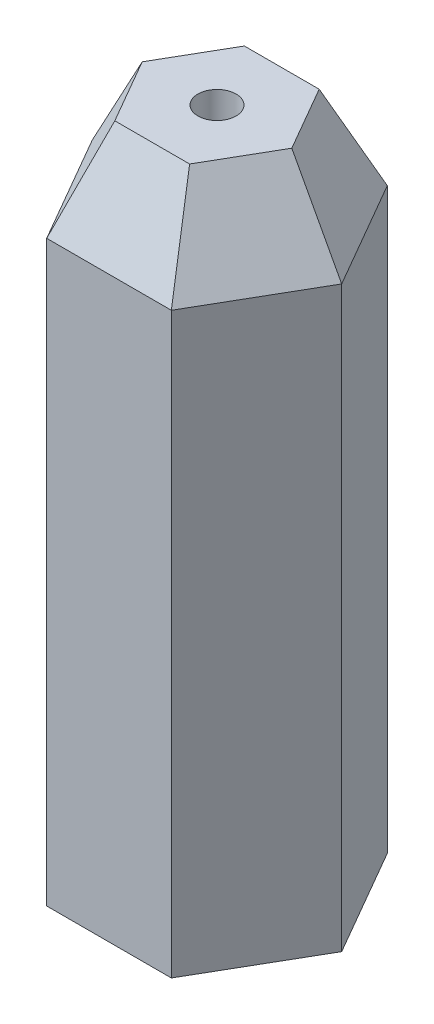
ISO-10303-21;
HEADER;
FILE_DESCRIPTION(('STEP AP214'),'2;1');
FILE_NAME('part.step','',(''),(''),'','','');
FILE_SCHEMA(('AUTOMOTIVE_DESIGN { 1 0 10303 214 1 1 1 1 }'));
ENDSEC;
DATA;
#1=APPLICATION_CONTEXT('core data for automotive mechanical design processes');
#2=APPLICATION_PROTOCOL_DEFINITION('international standard','automotive_design',2000,#1);
#3=PRODUCT_CONTEXT('',#1,'mechanical');
#4=PRODUCT('Part','Part','',(#3));
#5=PRODUCT_RELATED_PRODUCT_CATEGORY('part','',(#4));
#6=PRODUCT_DEFINITION_FORMATION('','',#4);
#7=PRODUCT_DEFINITION_CONTEXT('part definition',#1,'design');
#8=PRODUCT_DEFINITION('design','',#6,#7);
#9=PRODUCT_DEFINITION_SHAPE('','',#8);
#10=(LENGTH_UNIT() NAMED_UNIT(*) SI_UNIT(.MILLI.,.METRE.));
#11=(NAMED_UNIT(*) PLANE_ANGLE_UNIT() SI_UNIT($,.RADIAN.));
#12=(NAMED_UNIT(*) SI_UNIT($,.STERADIAN.) SOLID_ANGLE_UNIT());
#13=UNCERTAINTY_MEASURE_WITH_UNIT(LENGTH_MEASURE(1.E-05),#10,'distance_accuracy_value','');
#14=(GEOMETRIC_REPRESENTATION_CONTEXT(3) GLOBAL_UNCERTAINTY_ASSIGNED_CONTEXT((#13)) GLOBAL_UNIT_ASSIGNED_CONTEXT((#10,
#11,#12)) REPRESENTATION_CONTEXT('',''));
#15=CARTESIAN_POINT('',(0.,0.,0.));
#16=DIRECTION('',(0.,0.,1.));
#17=DIRECTION('',(1.,0.,0.));
#18=AXIS2_PLACEMENT_3D('',#15,#16,#17);
#19=CARTESIAN_POINT('',(0.,46.6,0.));
#20=DIRECTION('',(0.,-1.,0.));
#21=DIRECTION('',(0.,0.,-1.));
#22=AXIS2_PLACEMENT_3D('',#19,#20,#21);
#23=CYLINDRICAL_SURFACE('',#22,1.325);
#24=CARTESIAN_POINT('',(0.,0.,0.));
#25=DIRECTION('',(0.,1.,0.));
#26=DIRECTION('',(0.,0.,1.));
#27=AXIS2_PLACEMENT_3D('',#24,#25,#26);
#28=CIRCLE('',#27,1.325);
#29=CARTESIAN_POINT('',(0.,0.,1.325));
#30=VERTEX_POINT('',#29);
#31=EDGE_CURVE('E155',#30,#30,#28,.T.);
#32=ORIENTED_EDGE('',*,*,#31,.F.);
#33=EDGE_LOOP('',(#32));
#34=FACE_BOUND('',#33,.T.);
#35=CARTESIAN_POINT('',(0.,12.,0.));
#36=DIRECTION('',(0.,1.,0.));
#37=DIRECTION('',(0.,0.,1.));
#38=AXIS2_PLACEMENT_3D('',#35,#36,#37);
#39=CIRCLE('',#38,1.325);
#40=CARTESIAN_POINT('',(0.,12.,1.325));
#41=VERTEX_POINT('',#40);
#42=EDGE_CURVE('E240',#41,#41,#39,.F.);
#43=ORIENTED_EDGE('',*,*,#42,.F.);
#44=EDGE_LOOP('',(#43));
#45=FACE_BOUND('',#44,.T.);
#46=ADVANCED_FACE('F46',(#34,#45),#23,.F.);
#47=CARTESIAN_POINT('',(0.,46.6,0.));
#48=DIRECTION('',(0.,1.,0.));
#49=DIRECTION('',(0.,0.,1.));
#50=AXIS2_PLACEMENT_3D('',#47,#48,#49);
#51=PLANE('',#50);
#52=DIRECTION('',(-0.5,0.,0.866025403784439));
#53=VECTOR('',#52,1.);
#54=CARTESIAN_POINT('',(-6.06217782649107,46.6,1.5));
#55=LINE('',#54,#53);
#56=CARTESIAN_POINT('',(-2.59807621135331,46.6,-4.5));
#57=VERTEX_POINT('',#56);
#58=CARTESIAN_POINT('',(-5.19615242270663,46.6,0.));
#59=VERTEX_POINT('',#58);
#60=EDGE_CURVE('E200',#57,#59,#55,.T.);
#61=ORIENTED_EDGE('',*,*,#60,.T.);
#62=DIRECTION('',(0.5,0.,0.866025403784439));
#63=VECTOR('',#62,1.);
#64=CARTESIAN_POINT('',(-1.73205080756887,46.6,6.));
#65=LINE('',#64,#63);
#66=CARTESIAN_POINT('',(-2.59807621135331,46.6,4.49999999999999));
#67=VERTEX_POINT('',#66);
#68=EDGE_CURVE('E203',#59,#67,#65,.T.);
#69=ORIENTED_EDGE('',*,*,#68,.T.);
#70=DIRECTION('',(1.,0.,0.));
#71=VECTOR('',#70,1.);
#72=CARTESIAN_POINT('',(4.3301270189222,46.6,4.49999999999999));
#73=LINE('',#72,#71);
#74=CARTESIAN_POINT('',(2.59807621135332,46.6,4.49999999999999));
#75=VERTEX_POINT('',#74);
#76=EDGE_CURVE('E188',#67,#75,#73,.T.);
#77=ORIENTED_EDGE('',*,*,#76,.T.);
#78=DIRECTION('',(0.5,0.,-0.866025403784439));
#79=VECTOR('',#78,1.);
#80=CARTESIAN_POINT('',(6.06217782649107,46.6,-1.5));
#81=LINE('',#80,#79);
#82=CARTESIAN_POINT('',(5.19615242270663,46.6,0.));
#83=VERTEX_POINT('',#82);
#84=EDGE_CURVE('E191',#75,#83,#81,.T.);
#85=ORIENTED_EDGE('',*,*,#84,.T.);
#86=DIRECTION('',(-0.5,0.,-0.866025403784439));
#87=VECTOR('',#86,1.);
#88=CARTESIAN_POINT('',(1.73205080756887,46.6,-6.));
#89=LINE('',#88,#87);
#90=CARTESIAN_POINT('',(2.59807621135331,46.6,-4.5));
#91=VERTEX_POINT('',#90);
#92=EDGE_CURVE('E194',#83,#91,#89,.T.);
#93=ORIENTED_EDGE('',*,*,#92,.T.);
#94=DIRECTION('',(-1.,0.,0.));
#95=VECTOR('',#94,1.);
#96=CARTESIAN_POINT('',(-4.33012701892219,46.6,-4.5));
#97=LINE('',#96,#95);
#98=EDGE_CURVE('E197',#91,#57,#97,.T.);
#99=ORIENTED_EDGE('',*,*,#98,.T.);
#100=EDGE_LOOP('',(#61,#69,#77,#85,#93,#99));
#101=FACE_BOUND('',#100,.T.);
#102=CARTESIAN_POINT('',(0.,46.6,0.));
#103=DIRECTION('',(0.,1.,0.));
#104=DIRECTION('',(0.,0.,1.));
#105=AXIS2_PLACEMENT_3D('',#102,#103,#104);
#106=CIRCLE('',#105,1.325);
#107=CARTESIAN_POINT('',(0.,46.6,1.325));
#108=VERTEX_POINT('',#107);
#109=EDGE_CURVE('E151',#108,#108,#106,.T.);
#110=ORIENTED_EDGE('',*,*,#109,.F.);
#111=EDGE_LOOP('',(#110));
#112=FACE_BOUND('',#111,.T.);
#113=ADVANCED_FACE('F256',(#101,#112),#51,.T.);
#114=CARTESIAN_POINT('',(0.,0.,0.));
#115=DIRECTION('',(0.,1.,0.));
#116=DIRECTION('',(0.,0.,1.));
#117=AXIS2_PLACEMENT_3D('',#114,#115,#116);
#118=PLANE('',#117);
#119=DIRECTION('',(-0.5,0.,0.866025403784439));
#120=VECTOR('',#119,1.);
#121=CARTESIAN_POINT('',(-4.33012701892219,0.,-7.5));
#122=LINE('',#121,#120);
#123=CARTESIAN_POINT('',(-4.33012701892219,0.,-7.5));
#124=VERTEX_POINT('',#123);
#125=CARTESIAN_POINT('',(-8.66025403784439,0.,0.));
#126=VERTEX_POINT('',#125);
#127=EDGE_CURVE('E140',#124,#126,#122,.T.);
#128=ORIENTED_EDGE('',*,*,#127,.F.);
#129=DIRECTION('',(-1.,0.,0.));
#130=VECTOR('',#129,1.);
#131=CARTESIAN_POINT('',(4.3301270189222,0.,-7.5));
#132=LINE('',#131,#130);
#133=CARTESIAN_POINT('',(4.3301270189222,0.,-7.5));
#134=VERTEX_POINT('',#133);
#135=EDGE_CURVE('E169',#134,#124,#132,.T.);
#136=ORIENTED_EDGE('',*,*,#135,.F.);
#137=DIRECTION('',(-0.5,0.,-0.866025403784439));
#138=VECTOR('',#137,1.);
#139=CARTESIAN_POINT('',(8.66025403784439,0.,0.));
#140=LINE('',#139,#138);
#141=CARTESIAN_POINT('',(8.66025403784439,0.,0.));
#142=VERTEX_POINT('',#141);
#143=EDGE_CURVE('E165',#142,#134,#140,.T.);
#144=ORIENTED_EDGE('',*,*,#143,.F.);
#145=DIRECTION('',(0.5,0.,-0.866025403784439));
#146=VECTOR('',#145,1.);
#147=CARTESIAN_POINT('',(4.3301270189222,0.,7.5));
#148=LINE('',#147,#146);
#149=CARTESIAN_POINT('',(4.3301270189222,0.,7.5));
#150=VERTEX_POINT('',#149);
#151=EDGE_CURVE('E161',#150,#142,#148,.T.);
#152=ORIENTED_EDGE('',*,*,#151,.F.);
#153=DIRECTION('',(1.,0.,0.));
#154=VECTOR('',#153,1.);
#155=CARTESIAN_POINT('',(-4.3301270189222,0.,7.5));
#156=LINE('',#155,#154);
#157=CARTESIAN_POINT('',(-4.3301270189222,0.,7.5));
#158=VERTEX_POINT('',#157);
#159=EDGE_CURVE('E143',#158,#150,#156,.T.);
#160=ORIENTED_EDGE('',*,*,#159,.F.);
#161=DIRECTION('',(0.5,0.,0.866025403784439));
#162=VECTOR('',#161,1.);
#163=CARTESIAN_POINT('',(-8.66025403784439,0.,0.));
#164=LINE('',#163,#162);
#165=EDGE_CURVE('E125',#126,#158,#164,.T.);
#166=ORIENTED_EDGE('',*,*,#165,.F.);
#167=EDGE_LOOP('',(#128,#136,#144,#152,#160,#166));
#168=FACE_BOUND('',#167,.T.);
#169=ORIENTED_EDGE('',*,*,#31,.T.);
#170=EDGE_LOOP('',(#169));
#171=FACE_BOUND('',#170,.T.);
#172=ADVANCED_FACE('F137',(#168,#171),#118,.F.);
#173=CARTESIAN_POINT('',(-4.33012701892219,46.6,-7.5));
#174=DIRECTION('',(0.866025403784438,0.,0.5));
#175=DIRECTION('',(0.5,0.,-0.866025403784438));
#176=AXIS2_PLACEMENT_3D('',#173,#174,#175);
#177=PLANE('',#176);
#178=DIRECTION('',(0.,-1.,0.));
#179=VECTOR('',#178,1.);
#180=CARTESIAN_POINT('',(-8.66025403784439,46.6,0.));
#181=LINE('',#180,#179);
#182=CARTESIAN_POINT('',(-8.66025403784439,40.1664792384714,0.));
#183=VERTEX_POINT('',#182);
#184=EDGE_CURVE('E121',#183,#126,#181,.T.);
#185=ORIENTED_EDGE('',*,*,#184,.F.);
#186=DIRECTION('',(0.5,0.,-0.866025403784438));
#187=VECTOR('',#186,1.);
#188=CARTESIAN_POINT('',(-4.33012701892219,40.1664792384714,-7.5));
#189=LINE('',#188,#187);
#190=CARTESIAN_POINT('',(-4.33012701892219,40.1664792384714,-7.5));
#191=VERTEX_POINT('',#190);
#192=EDGE_CURVE('E209',#183,#191,#189,.T.);
#193=ORIENTED_EDGE('',*,*,#192,.T.);
#194=DIRECTION('',(0.,-1.,0.));
#195=VECTOR('',#194,1.);
#196=CARTESIAN_POINT('',(-4.33012701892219,46.6,-7.5));
#197=LINE('',#196,#195);
#198=EDGE_CURVE('E148',#191,#124,#197,.T.);
#199=ORIENTED_EDGE('',*,*,#198,.T.);
#200=ORIENTED_EDGE('',*,*,#127,.T.);
#201=EDGE_LOOP('',(#185,#193,#199,#200));
#202=FACE_BOUND('',#201,.T.);
#203=ADVANCED_FACE('F146',(#202),#177,.F.);
#204=CARTESIAN_POINT('',(-8.66025403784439,46.6,0.));
#205=DIRECTION('',(0.866025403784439,0.,-0.5));
#206=DIRECTION('',(-0.5,0.,-0.866025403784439));
#207=AXIS2_PLACEMENT_3D('',#204,#205,#206);
#208=PLANE('',#207);
#209=DIRECTION('',(0.,-1.,0.));
#210=VECTOR('',#209,1.);
#211=CARTESIAN_POINT('',(-4.3301270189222,46.6,7.5));
#212=LINE('',#211,#210);
#213=CARTESIAN_POINT('',(-4.3301270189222,40.1664792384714,7.5));
#214=VERTEX_POINT('',#213);
#215=EDGE_CURVE('E133',#214,#158,#212,.T.);
#216=ORIENTED_EDGE('',*,*,#215,.F.);
#217=DIRECTION('',(-0.5,0.,-0.866025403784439));
#218=VECTOR('',#217,1.);
#219=CARTESIAN_POINT('',(-8.66025403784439,40.1664792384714,0.));
#220=LINE('',#219,#218);
#221=EDGE_CURVE('E128',#214,#183,#220,.T.);
#222=ORIENTED_EDGE('',*,*,#221,.T.);
#223=ORIENTED_EDGE('',*,*,#184,.T.);
#224=ORIENTED_EDGE('',*,*,#165,.T.);
#225=EDGE_LOOP('',(#216,#222,#223,#224));
#226=FACE_BOUND('',#225,.T.);
#227=ADVANCED_FACE('F124',(#226),#208,.F.);
#228=CARTESIAN_POINT('',(-4.3301270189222,46.6,7.5));
#229=DIRECTION('',(0.,0.,-1.));
#230=DIRECTION('',(-1.,0.,0.));
#231=AXIS2_PLACEMENT_3D('',#228,#229,#230);
#232=PLANE('',#231);
#233=DIRECTION('',(0.,-1.,0.));
#234=VECTOR('',#233,1.);
#235=CARTESIAN_POINT('',(4.3301270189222,46.6,7.5));
#236=LINE('',#235,#234);
#237=CARTESIAN_POINT('',(4.3301270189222,40.1664792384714,7.5));
#238=VERTEX_POINT('',#237);
#239=EDGE_CURVE('E180',#238,#150,#236,.T.);
#240=ORIENTED_EDGE('',*,*,#239,.F.);
#241=DIRECTION('',(-1.,0.,0.));
#242=VECTOR('',#241,1.);
#243=CARTESIAN_POINT('',(-4.3301270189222,40.1664792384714,7.5));
#244=LINE('',#243,#242);
#245=EDGE_CURVE('E12',#238,#214,#244,.T.);
#246=ORIENTED_EDGE('',*,*,#245,.T.);
#247=ORIENTED_EDGE('',*,*,#215,.T.);
#248=ORIENTED_EDGE('',*,*,#159,.T.);
#249=EDGE_LOOP('',(#240,#246,#247,#248));
#250=FACE_BOUND('',#249,.T.);
#251=ADVANCED_FACE('F303',(#250),#232,.F.);
#252=CARTESIAN_POINT('',(4.3301270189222,46.6,7.5));
#253=DIRECTION('',(-0.866025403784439,0.,-0.5));
#254=DIRECTION('',(-0.5,0.,0.866025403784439));
#255=AXIS2_PLACEMENT_3D('',#252,#253,#254);
#256=PLANE('',#255);
#257=DIRECTION('',(0.,-1.,0.));
#258=VECTOR('',#257,1.);
#259=CARTESIAN_POINT('',(8.66025403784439,46.6,0.));
#260=LINE('',#259,#258);
#261=CARTESIAN_POINT('',(8.66025403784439,40.1664792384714,0.));
#262=VERTEX_POINT('',#261);
#263=EDGE_CURVE('E177',#262,#142,#260,.T.);
#264=ORIENTED_EDGE('',*,*,#263,.F.);
#265=DIRECTION('',(-0.5,0.,0.866025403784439));
#266=VECTOR('',#265,1.);
#267=CARTESIAN_POINT('',(4.3301270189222,40.1664792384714,7.5));
#268=LINE('',#267,#266);
#269=EDGE_CURVE('E57',#262,#238,#268,.T.);
#270=ORIENTED_EDGE('',*,*,#269,.T.);
#271=ORIENTED_EDGE('',*,*,#239,.T.);
#272=ORIENTED_EDGE('',*,*,#151,.T.);
#273=EDGE_LOOP('',(#264,#270,#271,#272));
#274=FACE_BOUND('',#273,.T.);
#275=ADVANCED_FACE('F314',(#274),#256,.F.);
#276=CARTESIAN_POINT('',(8.66025403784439,46.6,0.));
#277=DIRECTION('',(-0.866025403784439,0.,0.5));
#278=DIRECTION('',(0.5,0.,0.866025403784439));
#279=AXIS2_PLACEMENT_3D('',#276,#277,#278);
#280=PLANE('',#279);
#281=DIRECTION('',(0.,-1.,0.));
#282=VECTOR('',#281,1.);
#283=CARTESIAN_POINT('',(4.3301270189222,46.6,-7.5));
#284=LINE('',#283,#282);
#285=CARTESIAN_POINT('',(4.3301270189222,40.1664792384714,-7.5));
#286=VERTEX_POINT('',#285);
#287=EDGE_CURVE('E174',#286,#134,#284,.T.);
#288=ORIENTED_EDGE('',*,*,#287,.F.);
#289=DIRECTION('',(0.5,0.,0.866025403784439));
#290=VECTOR('',#289,1.);
#291=CARTESIAN_POINT('',(8.66025403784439,40.1664792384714,0.));
#292=LINE('',#291,#290);
#293=EDGE_CURVE('E72',#286,#262,#292,.T.);
#294=ORIENTED_EDGE('',*,*,#293,.T.);
#295=ORIENTED_EDGE('',*,*,#263,.T.);
#296=ORIENTED_EDGE('',*,*,#143,.T.);
#297=EDGE_LOOP('',(#288,#294,#295,#296));
#298=FACE_BOUND('',#297,.T.);
#299=ADVANCED_FACE('F277',(#298),#280,.F.);
#300=CARTESIAN_POINT('',(4.3301270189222,46.6,-7.5));
#301=DIRECTION('',(0.,0.,1.));
#302=DIRECTION('',(1.,0.,0.));
#303=AXIS2_PLACEMENT_3D('',#300,#301,#302);
#304=PLANE('',#303);
#305=ORIENTED_EDGE('',*,*,#198,.F.);
#306=DIRECTION('',(1.,0.,0.));
#307=VECTOR('',#306,1.);
#308=CARTESIAN_POINT('',(4.3301270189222,40.1664792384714,-7.5));
#309=LINE('',#308,#307);
#310=EDGE_CURVE('E212',#191,#286,#309,.T.);
#311=ORIENTED_EDGE('',*,*,#310,.T.);
#312=ORIENTED_EDGE('',*,*,#287,.T.);
#313=ORIENTED_EDGE('',*,*,#135,.T.);
#314=EDGE_LOOP('',(#305,#311,#312,#313));
#315=FACE_BOUND('',#314,.T.);
#316=ADVANCED_FACE('F268',(#315),#304,.F.);
#317=CARTESIAN_POINT('',(0.,34.6,0.));
#318=DIRECTION('',(0.,1.,0.));
#319=DIRECTION('',(0.,0.,1.));
#320=AXIS2_PLACEMENT_3D('',#317,#318,#319);
#321=CIRCLE('',#320,1.325);
#322=CARTESIAN_POINT('',(0.,34.6,1.325));
#323=VERTEX_POINT('',#322);
#324=EDGE_CURVE('E132',#323,#323,#321,.T.);
#325=ORIENTED_EDGE('',*,*,#324,.F.);
#326=EDGE_LOOP('',(#325));
#327=FACE_BOUND('',#326,.T.);
#328=ORIENTED_EDGE('',*,*,#109,.T.);
#329=EDGE_LOOP('',(#328));
#330=FACE_BOUND('',#329,.T.);
#331=ADVANCED_FACE('F258',(#327,#330),#23,.F.);
#332=CARTESIAN_POINT('',(0.,12.,0.));
#333=DIRECTION('',(0.,1.,0.));
#334=DIRECTION('',(0.,0.,1.));
#335=AXIS2_PLACEMENT_3D('',#332,#333,#334);
#336=PLANE('',#335);
#337=ORIENTED_EDGE('',*,*,#42,.T.);
#338=EDGE_LOOP('',(#337));
#339=FACE_BOUND('',#338,.T.);
#340=ADVANCED_FACE('F267',(#339),#336,.F.);
#341=CARTESIAN_POINT('',(0.,34.6,0.));
#342=DIRECTION('',(0.,1.,0.));
#343=DIRECTION('',(0.,0.,1.));
#344=AXIS2_PLACEMENT_3D('',#341,#342,#343);
#345=PLANE('',#344);
#346=ORIENTED_EDGE('',*,*,#324,.T.);
#347=EDGE_LOOP('',(#346));
#348=FACE_BOUND('',#347,.T.);
#349=ADVANCED_FACE('F274',(#348),#345,.T.);
#350=CARTESIAN_POINT('',(3.89711431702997,46.6,-2.25));
#351=DIRECTION('',(0.784885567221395,0.422618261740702,-0.453153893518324));
#352=DIRECTION('',(0.5,0.,0.866025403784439));
#353=AXIS2_PLACEMENT_3D('',#350,#351,#352);
#354=PLANE('',#353);
#355=DIRECTION('',(-0.474089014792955,0.880476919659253,0.));
#356=VECTOR('',#355,1.);
#357=CARTESIAN_POINT('',(4.90418010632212,47.1422502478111,0.));
#358=LINE('',#357,#356);
#359=EDGE_CURVE('E232',#262,#83,#358,.T.);
#360=ORIENTED_EDGE('',*,*,#359,.F.);
#361=ORIENTED_EDGE('',*,*,#293,.F.);
#362=DIRECTION('',(-0.237044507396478,0.880476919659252,0.410573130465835));
#363=VECTOR('',#362,1.);
#364=CARTESIAN_POINT('',(2.45209005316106,47.1422502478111,-4.24714455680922));
#365=LINE('',#364,#363);
#366=EDGE_CURVE('E51',#91,#286,#365,.F.);
#367=ORIENTED_EDGE('',*,*,#366,.F.);
#368=ORIENTED_EDGE('',*,*,#92,.F.);
#369=EDGE_LOOP('',(#360,#361,#367,#368));
#370=FACE_BOUND('',#369,.T.);
#371=ADVANCED_FACE('F49',(#370),#354,.T.);
#372=CARTESIAN_POINT('',(0.,46.6,-4.5));
#373=DIRECTION('',(0.,0.422618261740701,-0.906307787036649));
#374=DIRECTION('',(1.,0.,0.));
#375=AXIS2_PLACEMENT_3D('',#372,#373,#374);
#376=PLANE('',#375);
#377=ORIENTED_EDGE('',*,*,#366,.T.);
#378=ORIENTED_EDGE('',*,*,#310,.F.);
#379=DIRECTION('',(0.237044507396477,0.880476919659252,0.410573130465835));
#380=VECTOR('',#379,1.);
#381=CARTESIAN_POINT('',(-2.45209005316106,47.1422502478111,-4.24714455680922));
#382=LINE('',#381,#380);
#383=EDGE_CURVE('E229',#57,#191,#382,.F.);
#384=ORIENTED_EDGE('',*,*,#383,.F.);
#385=ORIENTED_EDGE('',*,*,#98,.F.);
#386=EDGE_LOOP('',(#377,#378,#384,#385));
#387=FACE_BOUND('',#386,.T.);
#388=ADVANCED_FACE('F289',(#387),#376,.T.);
#389=CARTESIAN_POINT('',(3.89711431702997,46.6,2.25));
#390=DIRECTION('',(0.784885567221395,0.422618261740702,0.453153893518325));
#391=DIRECTION('',(-0.5,0.,0.866025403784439));
#392=AXIS2_PLACEMENT_3D('',#389,#390,#391);
#393=PLANE('',#392);
#394=ORIENTED_EDGE('',*,*,#359,.T.);
#395=ORIENTED_EDGE('',*,*,#84,.F.);
#396=DIRECTION('',(-0.237044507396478,0.880476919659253,-0.410573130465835));
#397=VECTOR('',#396,1.);
#398=CARTESIAN_POINT('',(2.45209005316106,47.1422502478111,4.24714455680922));
#399=LINE('',#398,#397);
#400=EDGE_CURVE('E225',#238,#75,#399,.T.);
#401=ORIENTED_EDGE('',*,*,#400,.F.);
#402=ORIENTED_EDGE('',*,*,#269,.F.);
#403=EDGE_LOOP('',(#394,#395,#401,#402));
#404=FACE_BOUND('',#403,.T.);
#405=ADVANCED_FACE('F294',(#404),#393,.T.);
#406=CARTESIAN_POINT('',(-3.89711431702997,46.6,-2.25));
#407=DIRECTION('',(-0.784885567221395,0.422618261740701,-0.453153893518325));
#408=DIRECTION('',(0.5,0.,-0.866025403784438));
#409=AXIS2_PLACEMENT_3D('',#406,#407,#408);
#410=PLANE('',#409);
#411=ORIENTED_EDGE('',*,*,#383,.T.);
#412=ORIENTED_EDGE('',*,*,#192,.F.);
#413=DIRECTION('',(0.474089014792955,0.880476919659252,0.));
#414=VECTOR('',#413,1.);
#415=CARTESIAN_POINT('',(-4.90418010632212,47.1422502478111,0.));
#416=LINE('',#415,#414);
#417=EDGE_CURVE('E222',#59,#183,#416,.F.);
#418=ORIENTED_EDGE('',*,*,#417,.F.);
#419=ORIENTED_EDGE('',*,*,#60,.F.);
#420=EDGE_LOOP('',(#411,#412,#418,#419));
#421=FACE_BOUND('',#420,.T.);
#422=ADVANCED_FACE('F311',(#421),#410,.T.);
#423=CARTESIAN_POINT('',(0.,46.6,4.49999999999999));
#424=DIRECTION('',(0.,0.422618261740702,0.906307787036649));
#425=DIRECTION('',(-1.,0.,0.));
#426=AXIS2_PLACEMENT_3D('',#423,#424,#425);
#427=PLANE('',#426);
#428=ORIENTED_EDGE('',*,*,#400,.T.);
#429=ORIENTED_EDGE('',*,*,#76,.F.);
#430=DIRECTION('',(-0.237044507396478,-0.880476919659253,0.410573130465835));
#431=VECTOR('',#430,1.);
#432=CARTESIAN_POINT('',(-2.45209005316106,47.1422502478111,4.24714455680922));
#433=LINE('',#432,#431);
#434=EDGE_CURVE('E219',#214,#67,#433,.F.);
#435=ORIENTED_EDGE('',*,*,#434,.F.);
#436=ORIENTED_EDGE('',*,*,#245,.F.);
#437=EDGE_LOOP('',(#428,#429,#435,#436));
#438=FACE_BOUND('',#437,.T.);
#439=ADVANCED_FACE('F301',(#438),#427,.T.);
#440=CARTESIAN_POINT('',(-3.89711431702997,46.6,2.25));
#441=DIRECTION('',(-0.784885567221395,0.422618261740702,0.453153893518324));
#442=DIRECTION('',(-0.5,0.,-0.866025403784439));
#443=AXIS2_PLACEMENT_3D('',#440,#441,#442);
#444=PLANE('',#443);
#445=ORIENTED_EDGE('',*,*,#417,.T.);
#446=ORIENTED_EDGE('',*,*,#221,.F.);
#447=ORIENTED_EDGE('',*,*,#434,.T.);
#448=ORIENTED_EDGE('',*,*,#68,.F.);
#449=EDGE_LOOP('',(#445,#446,#447,#448));
#450=FACE_BOUND('',#449,.T.);
#451=ADVANCED_FACE('F305',(#450),#444,.T.);
#452=CLOSED_SHELL('',(#46,#113,#172,#203,#227,#251,#275,#299,#316,#331,#340,#349,#371,#388,#405,
#422,#439,#451));
#453=MANIFOLD_SOLID_BREP('B2',#452);
#454=ADVANCED_BREP_SHAPE_REPRESENTATION('',(#18,#453),#14);
#455=SHAPE_DEFINITION_REPRESENTATION(#9,#454);
ENDSEC;
END-ISO-10303-21;
